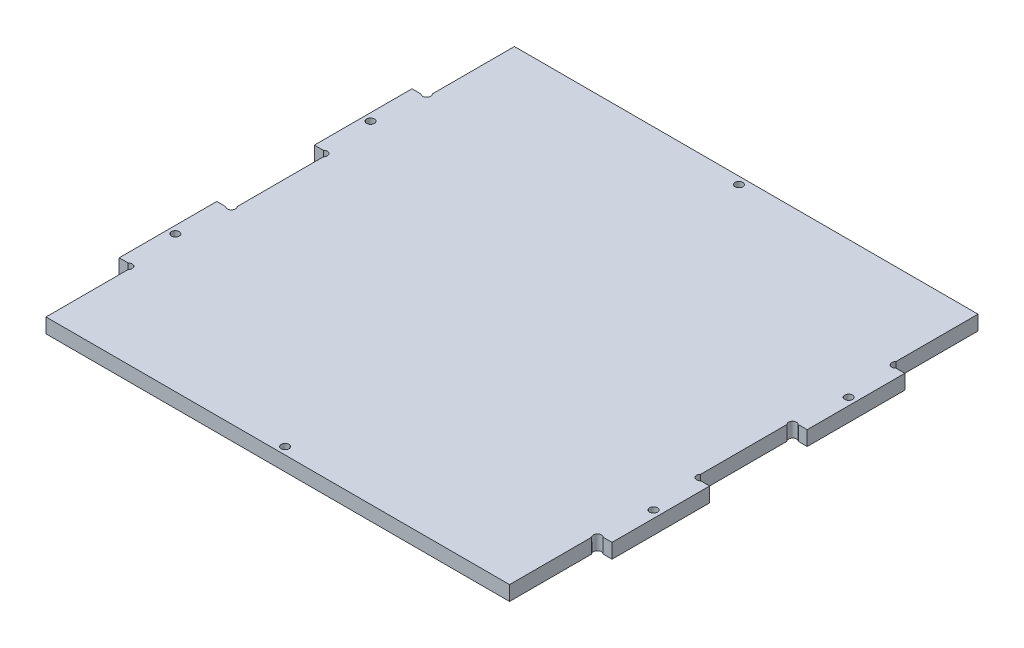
from build123d import *

# Parameters (mm, degrees)
ESQUISSE1_R        = 1.6
BOSS_EXTRU_1_DEPTH = 6


with BuildPart() as part:
    # Esquisse1 → Boss.-Extru.1 (new body)
    with BuildSketch(Plane(origin=(0, 0, 0), x_dir=(1, 0, 0), z_dir=(0, 1, 0))):
        with BuildLine():
            Line((-95, 96), (95, 96))
            Line((95, 96), (95, 62.334015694))
            ThreePointArc((95, 62.334015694), (95, 60), (97.334015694, 60))
            Line((97.334015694, 60), (101, 60))
            Line((101, 60), (101, 20))
            Line((101, 20), (97.334015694, 20))
            ThreePointArc((97.334015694, 20), (95, 20), (95, 17.665984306))
            Line((95, 17.665984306), (95, -17.665984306))
            ThreePointArc((95, -17.665984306), (95, -20), (97.334015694, -20))
            Line((97.334015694, -20), (101, -20))
            Line((101, -20), (101, -60))
            Line((101, -60), (97.334015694, -60))
            ThreePointArc((97.334015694, -60), (95, -60), (95, -62.334015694))
            Line((95, -62.334015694), (95, -96))
            Line((95, -96), (-95, -96))
            Line((-95, -96), (-95, -62.334015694))
            ThreePointArc((-95, -62.334015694), (-95, -60), (-97.334015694, -60))
            Line((-97.334015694, -60), (-101, -60))
            Line((-101, -60), (-101, -20))
            Line((-101, -20), (-97.334015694, -20))
            ThreePointArc((-97.334015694, -20), (-95, -20), (-95, -17.665984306))
            Line((-95, -17.665984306), (-95, 17.665984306))
            ThreePointArc((-95, 17.665984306), (-95, 20), (-97.334015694, 20))
            Line((-97.334015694, 20), (-101, 20))
            Line((-101, 20), (-101, 60))
            Line((-101, 60), (-97.334015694, 60))
            ThreePointArc((-97.334015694, 60), (-95, 60), (-95, 62.334015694))
            Line((-95, 62.334015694), (-95, 96))
        make_face()
        with Locations(Location((98, 40, 0), (0, 0, 270))):
            Circle(ESQUISSE1_R, mode=Mode.SUBTRACT)
        with Locations(Location((98, -40, 0), (0, 0, 90))):
            Circle(ESQUISSE1_R, mode=Mode.SUBTRACT)
        with Locations(Location((-98, -40, 0), (0, 0, 270))):
            Circle(ESQUISSE1_R, mode=Mode.SUBTRACT)
        with Locations(Location((-98, 40, 0), (0, 0, 90))):
            Circle(ESQUISSE1_R, mode=Mode.SUBTRACT)
        with Locations(Location((0, 93, 0), (0, 0, 270))):
            Circle(ESQUISSE1_R, mode=Mode.SUBTRACT)
        with Locations(Location((0, -93, 0), (0, 0, 90))):
            Circle(ESQUISSE1_R, mode=Mode.SUBTRACT)
    extrude(amount=BOSS_EXTRU_1_DEPTH)


solid = part.part
